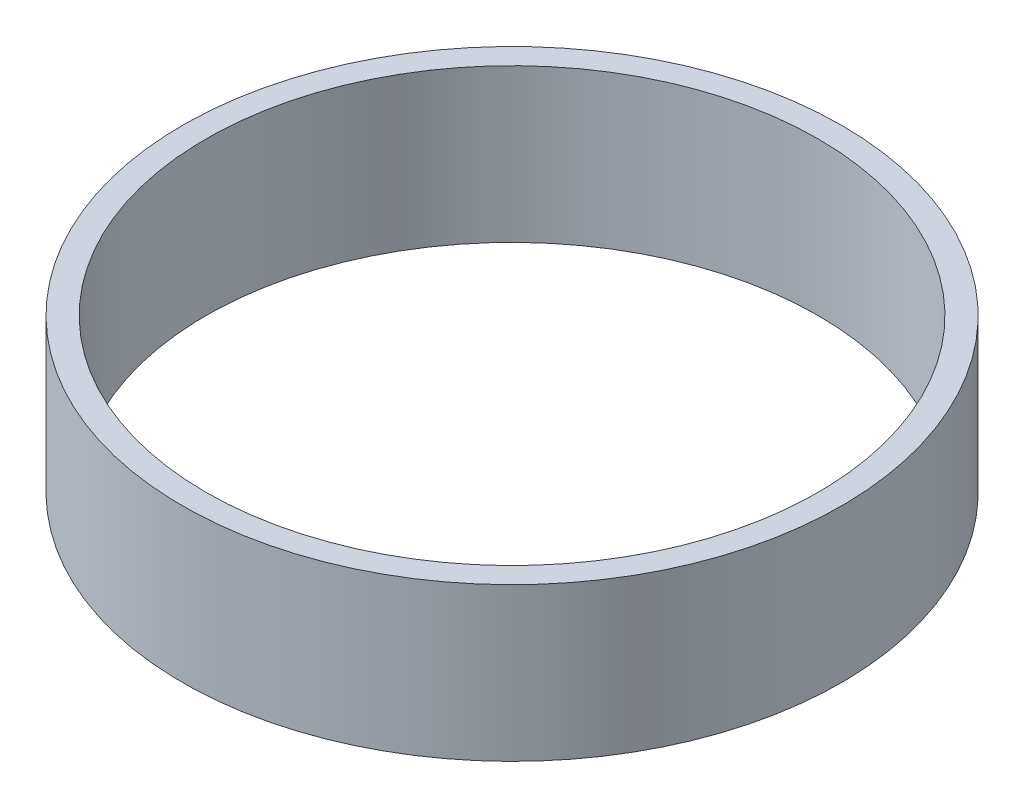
from build123d import *

# Parameters (mm, degrees)
SKETCH1_R           = 20.5105
SKETCH1_R_2         = 19.05
BOSS_EXTRUDE1_DEPTH = 9.525


with BuildPart() as part:
    # Sketch1 → Boss-Extrude1 (new body)
    with BuildSketch(Plane(origin=(0, 0, 0), x_dir=(1, 0, 0), z_dir=(0, 1, 0))):
        with Locations(Location((0, 0, 0), (0, 0, 90))):
            Circle(SKETCH1_R)
        with Locations(Location((0, 0, 0), (0, 0, 90))):
            Circle(SKETCH1_R_2, mode=Mode.SUBTRACT)
    extrude(amount=BOSS_EXTRUDE1_DEPTH)


solid = part.part
